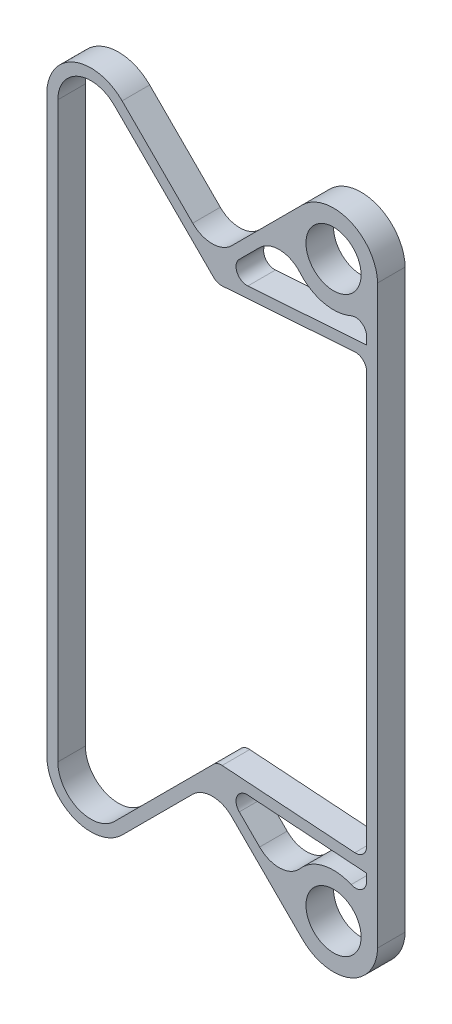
ISO-10303-21;
HEADER;
FILE_DESCRIPTION(('STEP AP214'),'2;1');
FILE_NAME('part.step','',(''),(''),'','','');
FILE_SCHEMA(('AUTOMOTIVE_DESIGN { 1 0 10303 214 1 1 1 1 }'));
ENDSEC;
DATA;
#1=APPLICATION_CONTEXT('core data for automotive mechanical design processes');
#2=APPLICATION_PROTOCOL_DEFINITION('international standard','automotive_design',2000,#1);
#3=PRODUCT_CONTEXT('',#1,'mechanical');
#4=PRODUCT('Part','Part','',(#3));
#5=PRODUCT_RELATED_PRODUCT_CATEGORY('part','',(#4));
#6=PRODUCT_DEFINITION_FORMATION('','',#4);
#7=PRODUCT_DEFINITION_CONTEXT('part definition',#1,'design');
#8=PRODUCT_DEFINITION('design','',#6,#7);
#9=PRODUCT_DEFINITION_SHAPE('','',#8);
#10=(LENGTH_UNIT() NAMED_UNIT(*) SI_UNIT(.MILLI.,.METRE.));
#11=(NAMED_UNIT(*) PLANE_ANGLE_UNIT() SI_UNIT($,.RADIAN.));
#12=(NAMED_UNIT(*) SI_UNIT($,.STERADIAN.) SOLID_ANGLE_UNIT());
#13=UNCERTAINTY_MEASURE_WITH_UNIT(LENGTH_MEASURE(1.E-05),#10,'distance_accuracy_value','');
#14=(GEOMETRIC_REPRESENTATION_CONTEXT(3) GLOBAL_UNCERTAINTY_ASSIGNED_CONTEXT((#13)) GLOBAL_UNIT_ASSIGNED_CONTEXT((#10,
#11,#12)) REPRESENTATION_CONTEXT('',''));
#15=CARTESIAN_POINT('',(0.,0.,0.));
#16=DIRECTION('',(0.,0.,1.));
#17=DIRECTION('',(1.,0.,0.));
#18=AXIS2_PLACEMENT_3D('',#15,#16,#17);
#19=CARTESIAN_POINT('',(192.426406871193,192.426406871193,50.));
#20=DIRECTION('',(0.707106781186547,0.707106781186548,0.));
#21=DIRECTION('',(-0.707106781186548,0.707106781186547,0.));
#22=AXIS2_PLACEMENT_3D('',#19,#20,#21);
#23=PLANE('',#22);
#24=DIRECTION('',(0.707106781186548,-0.707106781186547,0.));
#25=VECTOR('',#24,1.);
#26=CARTESIAN_POINT('',(192.426406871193,192.426406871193,0.));
#27=LINE('',#26,#25);
#28=CARTESIAN_POINT('',(-177.573593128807,562.426406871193,0.));
#29=VERTEX_POINT('',#28);
#30=CARTESIAN_POINT('',(2.50101613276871,382.351797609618,0.));
#31=VERTEX_POINT('',#30);
#32=EDGE_CURVE('E270',#29,#31,#27,.T.);
#33=ORIENTED_EDGE('',*,*,#32,.T.);
#34=DIRECTION('',(0.,0.,-1.));
#35=VECTOR('',#34,1.);
#36=CARTESIAN_POINT('',(2.50101613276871,382.351797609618,50.));
#37=LINE('',#36,#35);
#38=CARTESIAN_POINT('',(2.50101613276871,382.351797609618,50.));
#39=VERTEX_POINT('',#38);
#40=EDGE_CURVE('E12',#39,#31,#37,.T.);
#41=ORIENTED_EDGE('',*,*,#40,.F.);
#42=DIRECTION('',(0.707106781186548,-0.707106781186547,0.));
#43=VECTOR('',#42,1.);
#44=CARTESIAN_POINT('',(192.426406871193,192.426406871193,50.));
#45=LINE('',#44,#43);
#46=CARTESIAN_POINT('',(-177.573593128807,562.426406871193,50.));
#47=VERTEX_POINT('',#46);
#48=EDGE_CURVE('E416',#47,#39,#45,.T.);
#49=ORIENTED_EDGE('',*,*,#48,.F.);
#50=DIRECTION('',(0.,0.,-1.));
#51=VECTOR('',#50,1.);
#52=CARTESIAN_POINT('',(-177.573593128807,562.426406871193,50.));
#53=LINE('',#52,#51);
#54=EDGE_CURVE('E69',#47,#29,#53,.T.);
#55=ORIENTED_EDGE('',*,*,#54,.T.);
#56=EDGE_LOOP('',(#33,#41,#49,#55));
#57=FACE_BOUND('',#56,.T.);
#58=ADVANCED_FACE('F49',(#57),#23,.F.);
#59=CARTESIAN_POINT('',(16.6431517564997,396.493933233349,50.));
#60=DIRECTION('',(0.,0.,-1.));
#61=DIRECTION('',(-1.,0.,0.));
#62=AXIS2_PLACEMENT_3D('',#59,#60,#61);
#63=CYLINDRICAL_SURFACE('',#62,20.);
#64=CARTESIAN_POINT('',(16.6431517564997,396.493933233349,0.));
#65=DIRECTION('',(0.,0.,1.));
#66=DIRECTION('',(1.,0.,0.));
#67=AXIS2_PLACEMENT_3D('',#64,#65,#66);
#68=CIRCLE('',#67,20.);
#69=CARTESIAN_POINT('',(18.0308982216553,376.542137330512,0.));
#70=VERTEX_POINT('',#69);
#71=EDGE_CURVE('E273',#31,#70,#68,.T.);
#72=ORIENTED_EDGE('',*,*,#71,.T.);
#73=DIRECTION('',(0.,0.,-1.));
#74=VECTOR('',#73,1.);
#75=CARTESIAN_POINT('',(18.0308982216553,376.542137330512,50.));
#76=LINE('',#75,#74);
#77=CARTESIAN_POINT('',(18.0308982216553,376.542137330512,50.));
#78=VERTEX_POINT('',#77);
#79=EDGE_CURVE('E60',#78,#70,#76,.T.);
#80=ORIENTED_EDGE('',*,*,#79,.F.);
#81=CARTESIAN_POINT('',(16.6431517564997,396.493933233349,50.));
#82=DIRECTION('',(0.,0.,1.));
#83=DIRECTION('',(1.,0.,0.));
#84=AXIS2_PLACEMENT_3D('',#81,#82,#83);
#85=CIRCLE('',#84,20.);
#86=EDGE_CURVE('E420',#39,#78,#85,.T.);
#87=ORIENTED_EDGE('',*,*,#86,.F.);
#88=ORIENTED_EDGE('',*,*,#40,.T.);
#89=EDGE_LOOP('',(#72,#80,#87,#88));
#90=FACE_BOUND('',#89,.T.);
#91=ADVANCED_FACE('F566',(#90),#63,.T.);
#92=CARTESIAN_POINT('',(-25.9774674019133,373.481137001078,50.));
#93=DIRECTION('',(0.0693873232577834,-0.997589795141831,0.));
#94=DIRECTION('',(0.997589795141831,0.0693873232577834,0.));
#95=AXIS2_PLACEMENT_3D('',#92,#93,#94);
#96=PLANE('',#95);
#97=DIRECTION('',(-0.997589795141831,-0.0693873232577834,0.));
#98=VECTOR('',#97,1.);
#99=CARTESIAN_POINT('',(-25.9774674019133,373.481137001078,0.));
#100=LINE('',#99,#98);
#101=CARTESIAN_POINT('',(258.579458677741,393.273484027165,0.));
#102=VERTEX_POINT('',#101);
#103=EDGE_CURVE('E277',#102,#70,#100,.T.);
#104=ORIENTED_EDGE('',*,*,#103,.F.);
#105=DIRECTION('',(0.,0.,-1.));
#106=VECTOR('',#105,1.);
#107=CARTESIAN_POINT('',(258.579458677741,393.273484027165,50.));
#108=LINE('',#107,#106);
#109=CARTESIAN_POINT('',(258.579458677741,393.273484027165,50.));
#110=VERTEX_POINT('',#109);
#111=EDGE_CURVE('E344',#110,#102,#108,.T.);
#112=ORIENTED_EDGE('',*,*,#111,.F.);
#113=DIRECTION('',(-0.997589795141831,-0.0693873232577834,0.));
#114=VECTOR('',#113,1.);
#115=CARTESIAN_POINT('',(-25.9774674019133,373.481137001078,50.));
#116=LINE('',#115,#114);
#117=EDGE_CURVE('E423',#110,#78,#116,.T.);
#118=ORIENTED_EDGE('',*,*,#117,.T.);
#119=ORIENTED_EDGE('',*,*,#79,.T.);
#120=EDGE_LOOP('',(#104,#112,#118,#119));
#121=FACE_BOUND('',#120,.T.);
#122=ADVANCED_FACE('F571',(#121),#96,.T.);
#123=CARTESIAN_POINT('',(259.967205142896,373.321688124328,50.));
#124=DIRECTION('',(0.,0.,-1.));
#125=DIRECTION('',(-1.,0.,0.));
#126=AXIS2_PLACEMENT_3D('',#123,#124,#125);
#127=CYLINDRICAL_SURFACE('',#126,20.);
#128=CARTESIAN_POINT('',(259.967205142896,373.321688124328,0.));
#129=DIRECTION('',(0.,0.,1.));
#130=DIRECTION('',(1.,0.,0.));
#131=AXIS2_PLACEMENT_3D('',#128,#129,#130);
#132=CIRCLE('',#131,20.);
#133=CARTESIAN_POINT('',(279.967205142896,373.321688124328,0.));
#134=VERTEX_POINT('',#133);
#135=EDGE_CURVE('E281',#134,#102,#132,.T.);
#136=ORIENTED_EDGE('',*,*,#135,.F.);
#137=DIRECTION('',(0.,0.,-1.));
#138=VECTOR('',#137,1.);
#139=CARTESIAN_POINT('',(279.967205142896,373.321688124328,50.));
#140=LINE('',#139,#138);
#141=CARTESIAN_POINT('',(279.967205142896,373.321688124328,50.));
#142=VERTEX_POINT('',#141);
#143=EDGE_CURVE('E341',#142,#134,#140,.T.);
#144=ORIENTED_EDGE('',*,*,#143,.F.);
#145=CARTESIAN_POINT('',(259.967205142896,373.321688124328,50.));
#146=DIRECTION('',(0.,0.,1.));
#147=DIRECTION('',(1.,0.,0.));
#148=AXIS2_PLACEMENT_3D('',#145,#146,#147);
#149=CIRCLE('',#148,20.);
#150=EDGE_CURVE('E427',#142,#110,#149,.T.);
#151=ORIENTED_EDGE('',*,*,#150,.T.);
#152=ORIENTED_EDGE('',*,*,#111,.T.);
#153=EDGE_LOOP('',(#136,#144,#151,#152));
#154=FACE_BOUND('',#153,.T.);
#155=ADVANCED_FACE('F631',(#154),#127,.F.);
#156=CARTESIAN_POINT('',(279.967205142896,0.,50.));
#157=DIRECTION('',(-1.,0.,0.));
#158=DIRECTION('',(0.,-1.,0.));
#159=AXIS2_PLACEMENT_3D('',#156,#157,#158);
#160=PLANE('',#159);
#161=DIRECTION('',(0.,1.,0.));
#162=VECTOR('',#161,1.);
#163=CARTESIAN_POINT('',(279.967205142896,0.,0.));
#164=LINE('',#163,#162);
#165=CARTESIAN_POINT('',(279.967205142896,-373.321688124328,0.));
#166=VERTEX_POINT('',#165);
#167=EDGE_CURVE('E285',#166,#134,#164,.T.);
#168=ORIENTED_EDGE('',*,*,#167,.F.);
#169=DIRECTION('',(0.,0.,-1.));
#170=VECTOR('',#169,1.);
#171=CARTESIAN_POINT('',(279.967205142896,-373.321688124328,50.));
#172=LINE('',#171,#170);
#173=CARTESIAN_POINT('',(279.967205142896,-373.321688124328,50.));
#174=VERTEX_POINT('',#173);
#175=EDGE_CURVE('E499',#174,#166,#172,.T.);
#176=ORIENTED_EDGE('',*,*,#175,.F.);
#177=DIRECTION('',(0.,1.,0.));
#178=VECTOR('',#177,1.);
#179=CARTESIAN_POINT('',(279.967205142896,0.,50.));
#180=LINE('',#179,#178);
#181=EDGE_CURVE('E431',#174,#142,#180,.T.);
#182=ORIENTED_EDGE('',*,*,#181,.T.);
#183=ORIENTED_EDGE('',*,*,#143,.T.);
#184=EDGE_LOOP('',(#168,#176,#182,#183));
#185=FACE_BOUND('',#184,.T.);
#186=ADVANCED_FACE('F627',(#185),#160,.T.);
#187=CARTESIAN_POINT('',(299.967205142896,0.,50.));
#188=DIRECTION('',(-1.,0.,0.));
#189=DIRECTION('',(0.,0.,1.));
#190=AXIS2_PLACEMENT_3D('',#187,#188,#189);
#191=PLANE('',#190);
#192=DIRECTION('',(0.,1.,0.));
#193=VECTOR('',#192,1.);
#194=CARTESIAN_POINT('',(299.967205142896,0.,0.));
#195=LINE('',#194,#193);
#196=CARTESIAN_POINT('',(299.967205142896,-522.290436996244,0.));
#197=VERTEX_POINT('',#196);
#198=CARTESIAN_POINT('',(299.967205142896,522.290436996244,0.));
#199=VERTEX_POINT('',#198);
#200=EDGE_CURVE('E289',#197,#199,#195,.T.);
#201=ORIENTED_EDGE('',*,*,#200,.T.);
#202=DIRECTION('',(0.,0.,-1.));
#203=VECTOR('',#202,1.);
#204=CARTESIAN_POINT('',(299.967205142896,522.290436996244,50.));
#205=LINE('',#204,#203);
#206=CARTESIAN_POINT('',(299.967205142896,522.290436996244,50.));
#207=VERTEX_POINT('',#206);
#208=EDGE_CURVE('E337',#207,#199,#205,.T.);
#209=ORIENTED_EDGE('',*,*,#208,.F.);
#210=DIRECTION('',(0.,1.,0.));
#211=VECTOR('',#210,1.);
#212=CARTESIAN_POINT('',(299.967205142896,0.,50.));
#213=LINE('',#212,#211);
#214=CARTESIAN_POINT('',(299.967205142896,-522.290436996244,50.));
#215=VERTEX_POINT('',#214);
#216=EDGE_CURVE('E435',#215,#207,#213,.T.);
#217=ORIENTED_EDGE('',*,*,#216,.F.);
#218=DIRECTION('',(0.,0.,-1.));
#219=VECTOR('',#218,1.);
#220=CARTESIAN_POINT('',(299.967205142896,-522.290436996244,50.));
#221=LINE('',#220,#219);
#222=EDGE_CURVE('E495',#215,#197,#221,.T.);
#223=ORIENTED_EDGE('',*,*,#222,.T.);
#224=EDGE_LOOP('',(#201,#209,#217,#223));
#225=FACE_BOUND('',#224,.T.);
#226=ADVANCED_FACE('F623',(#225),#191,.F.);
#227=CARTESIAN_POINT('',(219.999999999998,519.999999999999,50.));
#228=DIRECTION('',(0.,0.,-1.));
#229=DIRECTION('',(-1.,0.,0.));
#230=AXIS2_PLACEMENT_3D('',#227,#228,#229);
#231=CYLINDRICAL_SURFACE('',#230,80.0000000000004);
#232=CARTESIAN_POINT('',(219.999999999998,519.999999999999,0.));
#233=DIRECTION('',(0.,0.,1.));
#234=DIRECTION('',(1.,0.,0.));
#235=AXIS2_PLACEMENT_3D('',#232,#233,#234);
#236=CIRCLE('',#235,80.0000000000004);
#237=CARTESIAN_POINT('',(163.431457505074,576.568542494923,0.));
#238=VERTEX_POINT('',#237);
#239=EDGE_CURVE('E292',#199,#238,#236,.T.);
#240=ORIENTED_EDGE('',*,*,#239,.T.);
#241=DIRECTION('',(0.,0.,-1.));
#242=VECTOR('',#241,1.);
#243=CARTESIAN_POINT('',(163.431457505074,576.568542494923,50.));
#244=LINE('',#243,#242);
#245=CARTESIAN_POINT('',(163.431457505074,576.568542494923,50.));
#246=VERTEX_POINT('',#245);
#247=EDGE_CURVE('E334',#246,#238,#244,.T.);
#248=ORIENTED_EDGE('',*,*,#247,.F.);
#249=CARTESIAN_POINT('',(219.999999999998,519.999999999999,50.));
#250=DIRECTION('',(0.,0.,1.));
#251=DIRECTION('',(1.,0.,0.));
#252=AXIS2_PLACEMENT_3D('',#249,#250,#251);
#253=CIRCLE('',#252,80.0000000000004);
#254=EDGE_CURVE('E438',#207,#246,#253,.T.);
#255=ORIENTED_EDGE('',*,*,#254,.F.);
#256=ORIENTED_EDGE('',*,*,#208,.T.);
#257=EDGE_LOOP('',(#240,#248,#255,#256));
#258=FACE_BOUND('',#257,.T.);
#259=ADVANCED_FACE('F619',(#258),#231,.T.);
#260=CARTESIAN_POINT('',(-206.568542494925,206.568542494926,50.));
#261=DIRECTION('',(-0.707106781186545,0.70710678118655,0.));
#262=DIRECTION('',(-0.70710678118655,-0.707106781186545,0.));
#263=AXIS2_PLACEMENT_3D('',#260,#261,#262);
#264=PLANE('',#263);
#265=DIRECTION('',(0.70710678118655,0.707106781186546,0.));
#266=VECTOR('',#265,1.);
#267=CARTESIAN_POINT('',(-206.568542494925,206.568542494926,0.));
#268=LINE('',#267,#266);
#269=CARTESIAN_POINT('',(35.355339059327,448.492424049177,0.));
#270=VERTEX_POINT('',#269);
#271=EDGE_CURVE('E296',#270,#238,#268,.T.);
#272=ORIENTED_EDGE('',*,*,#271,.F.);
#273=DIRECTION('',(0.,0.,-1.));
#274=VECTOR('',#273,1.);
#275=CARTESIAN_POINT('',(35.355339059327,448.492424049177,50.));
#276=LINE('',#275,#274);
#277=CARTESIAN_POINT('',(35.355339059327,448.492424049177,50.));
#278=VERTEX_POINT('',#277);
#279=EDGE_CURVE('E331',#278,#270,#276,.T.);
#280=ORIENTED_EDGE('',*,*,#279,.F.);
#281=DIRECTION('',(0.70710678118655,0.707106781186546,0.));
#282=VECTOR('',#281,1.);
#283=CARTESIAN_POINT('',(-206.568542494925,206.568542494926,50.));
#284=LINE('',#283,#282);
#285=EDGE_CURVE('E441',#278,#246,#284,.T.);
#286=ORIENTED_EDGE('',*,*,#285,.T.);
#287=ORIENTED_EDGE('',*,*,#247,.T.);
#288=EDGE_LOOP('',(#272,#280,#286,#287));
#289=FACE_BOUND('',#288,.T.);
#290=ADVANCED_FACE('F615',(#289),#264,.T.);
#291=CARTESIAN_POINT('',(-4.9960036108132E-13,483.847763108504,50.));
#292=DIRECTION('',(0.,0.,-1.));
#293=DIRECTION('',(-1.,0.,0.));
#294=AXIS2_PLACEMENT_3D('',#291,#292,#293);
#295=CYLINDRICAL_SURFACE('',#294,50.);
#296=CARTESIAN_POINT('',(-4.9960036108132E-13,483.847763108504,0.));
#297=DIRECTION('',(0.,0.,1.));
#298=DIRECTION('',(1.,0.,0.));
#299=AXIS2_PLACEMENT_3D('',#296,#297,#298);
#300=CIRCLE('',#299,50.);
#301=CARTESIAN_POINT('',(-35.3553390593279,448.492424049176,0.));
#302=VERTEX_POINT('',#301);
#303=EDGE_CURVE('E300',#270,#302,#300,.F.);
#304=ORIENTED_EDGE('',*,*,#303,.T.);
#305=DIRECTION('',(0.,0.,-1.));
#306=VECTOR('',#305,1.);
#307=CARTESIAN_POINT('',(-35.3553390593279,448.492424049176,50.));
#308=LINE('',#307,#306);
#309=CARTESIAN_POINT('',(-35.3553390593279,448.492424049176,50.));
#310=VERTEX_POINT('',#309);
#311=EDGE_CURVE('E328',#310,#302,#308,.T.);
#312=ORIENTED_EDGE('',*,*,#311,.F.);
#313=CARTESIAN_POINT('',(-4.9960036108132E-13,483.847763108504,50.));
#314=DIRECTION('',(0.,0.,1.));
#315=DIRECTION('',(1.,0.,0.));
#316=AXIS2_PLACEMENT_3D('',#313,#314,#315);
#317=CIRCLE('',#316,50.);
#318=EDGE_CURVE('E445',#278,#310,#317,.F.);
#319=ORIENTED_EDGE('',*,*,#318,.F.);
#320=ORIENTED_EDGE('',*,*,#279,.T.);
#321=EDGE_LOOP('',(#304,#312,#319,#320));
#322=FACE_BOUND('',#321,.T.);
#323=ADVANCED_FACE('F612',(#322),#295,.F.);
#324=CARTESIAN_POINT('',(206.568542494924,206.568542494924,50.));
#325=DIRECTION('',(0.707106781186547,0.707106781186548,0.));
#326=DIRECTION('',(-0.707106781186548,0.707106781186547,0.));
#327=AXIS2_PLACEMENT_3D('',#324,#325,#326);
#328=PLANE('',#327);
#329=DIRECTION('',(0.707106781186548,-0.707106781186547,0.));
#330=VECTOR('',#329,1.);
#331=CARTESIAN_POINT('',(206.568542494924,206.568542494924,0.));
#332=LINE('',#331,#330);
#333=CARTESIAN_POINT('',(-163.431457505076,576.568542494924,0.));
#334=VERTEX_POINT('',#333);
#335=EDGE_CURVE('E304',#334,#302,#332,.T.);
#336=ORIENTED_EDGE('',*,*,#335,.F.);
#337=DIRECTION('',(0.,0.,-1.));
#338=VECTOR('',#337,1.);
#339=CARTESIAN_POINT('',(-163.431457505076,576.568542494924,50.));
#340=LINE('',#339,#338);
#341=CARTESIAN_POINT('',(-163.431457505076,576.568542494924,50.));
#342=VERTEX_POINT('',#341);
#343=EDGE_CURVE('E218',#342,#334,#340,.T.);
#344=ORIENTED_EDGE('',*,*,#343,.F.);
#345=DIRECTION('',(0.707106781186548,-0.707106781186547,0.));
#346=VECTOR('',#345,1.);
#347=CARTESIAN_POINT('',(206.568542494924,206.568542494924,50.));
#348=LINE('',#347,#346);
#349=EDGE_CURVE('E205',#342,#310,#348,.T.);
#350=ORIENTED_EDGE('',*,*,#349,.T.);
#351=ORIENTED_EDGE('',*,*,#311,.T.);
#352=EDGE_LOOP('',(#336,#344,#350,#351));
#353=FACE_BOUND('',#352,.T.);
#354=ADVANCED_FACE('F451',(#353),#328,.T.);
#355=CARTESIAN_POINT('',(-220.,520.,50.));
#356=DIRECTION('',(0.,0.,-1.));
#357=DIRECTION('',(-1.,0.,0.));
#358=AXIS2_PLACEMENT_3D('',#355,#356,#357);
#359=CYLINDRICAL_SURFACE('',#358,80.0000000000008);
#360=CARTESIAN_POINT('',(-220.,520.,0.));
#361=DIRECTION('',(0.,0.,1.));
#362=DIRECTION('',(1.,0.,0.));
#363=AXIS2_PLACEMENT_3D('',#360,#361,#362);
#364=CIRCLE('',#363,80.0000000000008);
#365=CARTESIAN_POINT('',(-300.000000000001,519.999999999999,0.));
#366=VERTEX_POINT('',#365);
#367=EDGE_CURVE('E213',#334,#366,#364,.T.);
#368=ORIENTED_EDGE('',*,*,#367,.T.);
#369=DIRECTION('',(0.,0.,-1.));
#370=VECTOR('',#369,1.);
#371=CARTESIAN_POINT('',(-300.000000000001,519.999999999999,50.));
#372=LINE('',#371,#370);
#373=CARTESIAN_POINT('',(-300.000000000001,519.999999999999,50.));
#374=VERTEX_POINT('',#373);
#375=EDGE_CURVE('E210',#374,#366,#372,.T.);
#376=ORIENTED_EDGE('',*,*,#375,.F.);
#377=CARTESIAN_POINT('',(-220.,520.,50.));
#378=DIRECTION('',(0.,0.,1.));
#379=DIRECTION('',(1.,0.,0.));
#380=AXIS2_PLACEMENT_3D('',#377,#378,#379);
#381=CIRCLE('',#380,80.0000000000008);
#382=EDGE_CURVE('E194',#342,#374,#381,.T.);
#383=ORIENTED_EDGE('',*,*,#382,.F.);
#384=ORIENTED_EDGE('',*,*,#343,.T.);
#385=EDGE_LOOP('',(#368,#376,#383,#384));
#386=FACE_BOUND('',#385,.T.);
#387=ADVANCED_FACE('F211',(#386),#359,.T.);
#388=CARTESIAN_POINT('',(-300.000000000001,0.,50.));
#389=DIRECTION('',(1.,0.,0.));
#390=DIRECTION('',(0.,0.,-1.));
#391=AXIS2_PLACEMENT_3D('',#388,#389,#390);
#392=PLANE('',#391);
#393=DIRECTION('',(0.,-1.,0.));
#394=VECTOR('',#393,1.);
#395=CARTESIAN_POINT('',(-300.000000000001,0.,0.));
#396=LINE('',#395,#394);
#397=CARTESIAN_POINT('',(-300.000000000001,-519.999999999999,0.));
#398=VERTEX_POINT('',#397);
#399=EDGE_CURVE('E310',#366,#398,#396,.T.);
#400=ORIENTED_EDGE('',*,*,#399,.T.);
#401=DIRECTION('',(0.,0.,-1.));
#402=VECTOR('',#401,1.);
#403=CARTESIAN_POINT('',(-300.000000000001,-519.999999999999,50.));
#404=LINE('',#403,#402);
#405=CARTESIAN_POINT('',(-300.000000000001,-519.999999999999,50.));
#406=VERTEX_POINT('',#405);
#407=EDGE_CURVE('E222',#406,#398,#404,.T.);
#408=ORIENTED_EDGE('',*,*,#407,.F.);
#409=DIRECTION('',(0.,-1.,0.));
#410=VECTOR('',#409,1.);
#411=CARTESIAN_POINT('',(-300.000000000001,0.,50.));
#412=LINE('',#411,#410);
#413=EDGE_CURVE('E202',#374,#406,#412,.T.);
#414=ORIENTED_EDGE('',*,*,#413,.F.);
#415=ORIENTED_EDGE('',*,*,#375,.T.);
#416=EDGE_LOOP('',(#400,#408,#414,#415));
#417=FACE_BOUND('',#416,.T.);
#418=ADVANCED_FACE('F220',(#417),#392,.F.);
#419=CARTESIAN_POINT('',(-280.000000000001,0.,50.));
#420=DIRECTION('',(1.,0.,0.));
#421=DIRECTION('',(0.,1.,0.));
#422=AXIS2_PLACEMENT_3D('',#419,#420,#421);
#423=PLANE('',#422);
#424=DIRECTION('',(0.,-1.,0.));
#425=VECTOR('',#424,1.);
#426=CARTESIAN_POINT('',(-280.000000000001,0.,0.));
#427=LINE('',#426,#425);
#428=CARTESIAN_POINT('',(-280.000000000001,520.,0.));
#429=VERTEX_POINT('',#428);
#430=CARTESIAN_POINT('',(-280.000000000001,-520.,0.));
#431=VERTEX_POINT('',#430);
#432=EDGE_CURVE('E313',#429,#431,#427,.T.);
#433=ORIENTED_EDGE('',*,*,#432,.F.);
#434=DIRECTION('',(0.,0.,-1.));
#435=VECTOR('',#434,1.);
#436=CARTESIAN_POINT('',(-280.000000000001,520.,50.));
#437=LINE('',#436,#435);
#438=CARTESIAN_POINT('',(-280.000000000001,520.,50.));
#439=VERTEX_POINT('',#438);
#440=EDGE_CURVE('E129',#439,#429,#437,.T.);
#441=ORIENTED_EDGE('',*,*,#440,.F.);
#442=DIRECTION('',(0.,-1.,0.));
#443=VECTOR('',#442,1.);
#444=CARTESIAN_POINT('',(-280.000000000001,0.,50.));
#445=LINE('',#444,#443);
#446=CARTESIAN_POINT('',(-280.000000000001,-520.,50.));
#447=VERTEX_POINT('',#446);
#448=EDGE_CURVE('E225',#439,#447,#445,.T.);
#449=ORIENTED_EDGE('',*,*,#448,.T.);
#450=DIRECTION('',(0.,0.,-1.));
#451=VECTOR('',#450,1.);
#452=CARTESIAN_POINT('',(-280.000000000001,-520.,50.));
#453=LINE('',#452,#451);
#454=EDGE_CURVE('E472',#447,#431,#453,.T.);
#455=ORIENTED_EDGE('',*,*,#454,.T.);
#456=EDGE_LOOP('',(#433,#441,#449,#455));
#457=FACE_BOUND('',#456,.T.);
#458=ADVANCED_FACE('F602',(#457),#423,.T.);
#459=CARTESIAN_POINT('',(259.967205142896,428.334180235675,50.));
#460=DIRECTION('',(0.,0.,-1.));
#461=DIRECTION('',(-1.,0.,0.));
#462=AXIS2_PLACEMENT_3D('',#459,#460,#461);
#463=CYLINDRICAL_SURFACE('',#462,20.);
#464=CARTESIAN_POINT('',(259.967205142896,428.334180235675,0.));
#465=DIRECTION('',(0.,0.,1.));
#466=DIRECTION('',(1.,0.,0.));
#467=AXIS2_PLACEMENT_3D('',#464,#465,#466);
#468=CIRCLE('',#467,20.);
#469=CARTESIAN_POINT('',(279.967205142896,428.334180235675,0.));
#470=VERTEX_POINT('',#469);
#471=CARTESIAN_POINT('',(251.973764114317,446.667344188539,0.));
#472=VERTEX_POINT('',#471);
#473=EDGE_CURVE('E241',#470,#472,#468,.T.);
#474=ORIENTED_EDGE('',*,*,#473,.F.);
#475=DIRECTION('',(0.,0.,-1.));
#476=VECTOR('',#475,1.);
#477=CARTESIAN_POINT('',(279.967205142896,428.334180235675,50.));
#478=LINE('',#477,#476);
#479=CARTESIAN_POINT('',(279.967205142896,428.334180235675,50.));
#480=VERTEX_POINT('',#479);
#481=EDGE_CURVE('E53',#480,#470,#478,.T.);
#482=ORIENTED_EDGE('',*,*,#481,.F.);
#483=CARTESIAN_POINT('',(259.967205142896,428.334180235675,50.));
#484=DIRECTION('',(0.,0.,1.));
#485=DIRECTION('',(1.,0.,0.));
#486=AXIS2_PLACEMENT_3D('',#483,#484,#485);
#487=CIRCLE('',#486,20.);
#488=CARTESIAN_POINT('',(251.973764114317,446.667344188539,50.));
#489=VERTEX_POINT('',#488);
#490=EDGE_CURVE('E402',#480,#489,#487,.T.);
#491=ORIENTED_EDGE('',*,*,#490,.T.);
#492=DIRECTION('',(0.,0.,-1.));
#493=VECTOR('',#492,1.);
#494=CARTESIAN_POINT('',(251.973764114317,446.667344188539,50.));
#495=LINE('',#494,#493);
#496=EDGE_CURVE('E236',#489,#472,#495,.T.);
#497=ORIENTED_EDGE('',*,*,#496,.T.);
#498=EDGE_LOOP('',(#474,#482,#491,#497));
#499=FACE_BOUND('',#498,.T.);
#500=ADVANCED_FACE('F378',(#499),#463,.F.);
#501=CARTESIAN_POINT('',(279.967205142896,0.,50.));
#502=DIRECTION('',(-1.,0.,0.));
#503=DIRECTION('',(0.,0.,1.));
#504=AXIS2_PLACEMENT_3D('',#501,#502,#503);
#505=PLANE('',#504);
#506=DIRECTION('',(0.,1.,0.));
#507=VECTOR('',#506,1.);
#508=CARTESIAN_POINT('',(279.967205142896,0.,0.));
#509=LINE('',#508,#507);
#510=CARTESIAN_POINT('',(279.967205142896,414.809428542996,0.));
#511=VERTEX_POINT('',#510);
#512=EDGE_CURVE('E246',#511,#470,#509,.T.);
#513=ORIENTED_EDGE('',*,*,#512,.F.);
#514=DIRECTION('',(0.,0.,-1.));
#515=VECTOR('',#514,1.);
#516=CARTESIAN_POINT('',(279.967205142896,414.809428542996,50.));
#517=LINE('',#516,#515);
#518=CARTESIAN_POINT('',(279.967205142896,414.809428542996,50.));
#519=VERTEX_POINT('',#518);
#520=EDGE_CURVE('E364',#519,#511,#517,.T.);
#521=ORIENTED_EDGE('',*,*,#520,.F.);
#522=DIRECTION('',(0.,1.,0.));
#523=VECTOR('',#522,1.);
#524=CARTESIAN_POINT('',(279.967205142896,0.,50.));
#525=LINE('',#524,#523);
#526=EDGE_CURVE('E377',#519,#480,#525,.T.);
#527=ORIENTED_EDGE('',*,*,#526,.T.);
#528=ORIENTED_EDGE('',*,*,#481,.T.);
#529=EDGE_LOOP('',(#513,#521,#527,#528));
#530=FACE_BOUND('',#529,.T.);
#531=ADVANCED_FACE('F375',(#530),#505,.T.);
#532=CARTESIAN_POINT('',(-27.3652138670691,393.432932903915,50.));
#533=DIRECTION('',(0.0693873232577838,-0.997589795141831,0.));
#534=DIRECTION('',(0.997589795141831,0.0693873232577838,0.));
#535=AXIS2_PLACEMENT_3D('',#532,#533,#534);
#536=PLANE('',#535);
#537=DIRECTION('',(-0.997589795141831,-0.0693873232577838,0.));
#538=VECTOR('',#537,1.);
#539=CARTESIAN_POINT('',(-27.3652138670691,393.432932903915,0.));
#540=LINE('',#539,#538);
#541=CARTESIAN_POINT('',(64.600612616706,399.829612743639,0.));
#542=VERTEX_POINT('',#541);
#543=EDGE_CURVE('E250',#511,#542,#540,.T.);
#544=ORIENTED_EDGE('',*,*,#543,.T.);
#545=DIRECTION('',(0.,0.,-1.));
#546=VECTOR('',#545,1.);
#547=CARTESIAN_POINT('',(64.600612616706,399.829612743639,50.));
#548=LINE('',#547,#546);
#549=CARTESIAN_POINT('',(64.600612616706,399.829612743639,50.));
#550=VERTEX_POINT('',#549);
#551=EDGE_CURVE('E361',#550,#542,#548,.T.);
#552=ORIENTED_EDGE('',*,*,#551,.F.);
#553=DIRECTION('',(-0.997589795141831,-0.0693873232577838,0.));
#554=VECTOR('',#553,1.);
#555=CARTESIAN_POINT('',(-27.3652138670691,393.432932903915,50.));
#556=LINE('',#555,#554);
#557=EDGE_CURVE('E387',#519,#550,#556,.T.);
#558=ORIENTED_EDGE('',*,*,#557,.F.);
#559=ORIENTED_EDGE('',*,*,#520,.T.);
#560=EDGE_LOOP('',(#544,#552,#558,#559));
#561=FACE_BOUND('',#560,.T.);
#562=ADVANCED_FACE('F385',(#561),#536,.F.);
#563=CARTESIAN_POINT('',(63.2128661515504,419.781408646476,50.));
#564=DIRECTION('',(0.,0.,-1.));
#565=DIRECTION('',(-1.,0.,0.));
#566=AXIS2_PLACEMENT_3D('',#563,#564,#565);
#567=CYLINDRICAL_SURFACE('',#566,20.);
#568=CARTESIAN_POINT('',(63.2128661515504,419.781408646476,0.));
#569=DIRECTION('',(0.,0.,1.));
#570=DIRECTION('',(1.,0.,0.));
#571=AXIS2_PLACEMENT_3D('',#568,#569,#570);
#572=CIRCLE('',#571,20.);
#573=CARTESIAN_POINT('',(49.0707305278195,433.923544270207,0.));
#574=VERTEX_POINT('',#573);
#575=EDGE_CURVE('E254',#542,#574,#572,.F.);
#576=ORIENTED_EDGE('',*,*,#575,.T.);
#577=DIRECTION('',(0.,0.,-1.));
#578=VECTOR('',#577,1.);
#579=CARTESIAN_POINT('',(49.0707305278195,433.923544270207,50.));
#580=LINE('',#579,#578);
#581=CARTESIAN_POINT('',(49.0707305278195,433.923544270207,50.));
#582=VERTEX_POINT('',#581);
#583=EDGE_CURVE('E357',#582,#574,#580,.T.);
#584=ORIENTED_EDGE('',*,*,#583,.F.);
#585=CARTESIAN_POINT('',(63.2128661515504,419.781408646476,50.));
#586=DIRECTION('',(0.,0.,1.));
#587=DIRECTION('',(1.,0.,0.));
#588=AXIS2_PLACEMENT_3D('',#585,#586,#587);
#589=CIRCLE('',#588,20.);
#590=EDGE_CURVE('E392',#550,#582,#589,.F.);
#591=ORIENTED_EDGE('',*,*,#590,.F.);
#592=ORIENTED_EDGE('',*,*,#551,.T.);
#593=EDGE_LOOP('',(#576,#584,#591,#592));
#594=FACE_BOUND('',#593,.T.);
#595=ADVANCED_FACE('F389',(#594),#567,.F.);
#596=CARTESIAN_POINT('',(-192.426406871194,192.426406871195,50.));
#597=DIRECTION('',(-0.707106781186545,0.70710678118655,0.));
#598=DIRECTION('',(-0.70710678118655,-0.707106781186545,0.));
#599=AXIS2_PLACEMENT_3D('',#596,#597,#598);
#600=PLANE('',#599);
#601=DIRECTION('',(0.70710678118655,0.707106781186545,0.));
#602=VECTOR('',#601,1.);
#603=CARTESIAN_POINT('',(-192.426406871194,192.426406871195,0.));
#604=LINE('',#603,#602);
#605=CARTESIAN_POINT('',(85.9220792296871,470.774892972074,0.));
#606=VERTEX_POINT('',#605);
#607=EDGE_CURVE('E258',#574,#606,#604,.T.);
#608=ORIENTED_EDGE('',*,*,#607,.T.);
#609=DIRECTION('',(0.,0.,-1.));
#610=VECTOR('',#609,1.);
#611=CARTESIAN_POINT('',(85.9220792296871,470.774892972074,50.));
#612=LINE('',#611,#610);
#613=CARTESIAN_POINT('',(85.9220792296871,470.774892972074,50.));
#614=VERTEX_POINT('',#613);
#615=EDGE_CURVE('E354',#614,#606,#612,.T.);
#616=ORIENTED_EDGE('',*,*,#615,.F.);
#617=DIRECTION('',(0.70710678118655,0.707106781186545,0.));
#618=VECTOR('',#617,1.);
#619=CARTESIAN_POINT('',(-192.426406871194,192.426406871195,50.));
#620=LINE('',#619,#618);
#621=EDGE_CURVE('E395',#582,#614,#620,.T.);
#622=ORIENTED_EDGE('',*,*,#621,.F.);
#623=ORIENTED_EDGE('',*,*,#583,.T.);
#624=EDGE_LOOP('',(#608,#616,#622,#623));
#625=FACE_BOUND('',#624,.T.);
#626=ADVANCED_FACE('F556',(#625),#600,.F.);
#627=CARTESIAN_POINT('',(121.277418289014,435.419553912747,50.));
#628=DIRECTION('',(0.,0.,-1.));
#629=DIRECTION('',(-1.,0.,0.));
#630=AXIS2_PLACEMENT_3D('',#627,#628,#629);
#631=CYLINDRICAL_SURFACE('',#630,50.);
#632=CARTESIAN_POINT('',(121.277418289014,435.419553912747,0.));
#633=DIRECTION('',(0.,0.,1.));
#634=DIRECTION('',(1.,0.,0.));
#635=AXIS2_PLACEMENT_3D('',#632,#633,#634);
#636=CIRCLE('',#635,50.);
#637=CARTESIAN_POINT('',(159.247642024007,467.950494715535,0.));
#638=VERTEX_POINT('',#637);
#639=EDGE_CURVE('E262',#638,#606,#636,.T.);
#640=ORIENTED_EDGE('',*,*,#639,.F.);
#641=DIRECTION('',(0.,0.,-1.));
#642=VECTOR('',#641,1.);
#643=CARTESIAN_POINT('',(159.247642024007,467.950494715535,50.));
#644=LINE('',#643,#642);
#645=CARTESIAN_POINT('',(159.247642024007,467.950494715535,50.));
#646=VERTEX_POINT('',#645);
#647=EDGE_CURVE('E351',#646,#638,#644,.T.);
#648=ORIENTED_EDGE('',*,*,#647,.F.);
#649=CARTESIAN_POINT('',(121.277418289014,435.419553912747,50.));
#650=DIRECTION('',(0.,0.,1.));
#651=DIRECTION('',(1.,0.,0.));
#652=AXIS2_PLACEMENT_3D('',#649,#650,#651);
#653=CIRCLE('',#652,50.);
#654=EDGE_CURVE('E407',#646,#614,#653,.T.);
#655=ORIENTED_EDGE('',*,*,#654,.T.);
#656=ORIENTED_EDGE('',*,*,#615,.T.);
#657=EDGE_LOOP('',(#640,#648,#655,#656));
#658=FACE_BOUND('',#657,.T.);
#659=ADVANCED_FACE('F553',(#658),#631,.F.);
#660=CARTESIAN_POINT('',(219.999999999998,519.999999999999,50.));
#661=DIRECTION('',(0.,0.,-1.));
#662=DIRECTION('',(-1.,0.,0.));
#663=AXIS2_PLACEMENT_3D('',#660,#661,#662);
#664=CYLINDRICAL_SURFACE('',#663,80.000000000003);
#665=CARTESIAN_POINT('',(219.999999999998,519.999999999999,0.));
#666=DIRECTION('',(0.,0.,1.));
#667=DIRECTION('',(1.,0.,0.));
#668=AXIS2_PLACEMENT_3D('',#665,#666,#667);
#669=CIRCLE('',#668,80.000000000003);
#670=EDGE_CURVE('E266',#638,#472,#669,.T.);
#671=ORIENTED_EDGE('',*,*,#670,.T.);
#672=ORIENTED_EDGE('',*,*,#496,.F.);
#673=CARTESIAN_POINT('',(219.999999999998,519.999999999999,50.));
#674=DIRECTION('',(0.,0.,1.));
#675=DIRECTION('',(1.,0.,0.));
#676=AXIS2_PLACEMENT_3D('',#673,#674,#675);
#677=CIRCLE('',#676,80.000000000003);
#678=EDGE_CURVE('E412',#646,#489,#677,.T.);
#679=ORIENTED_EDGE('',*,*,#678,.F.);
#680=ORIENTED_EDGE('',*,*,#647,.T.);
#681=EDGE_LOOP('',(#671,#672,#679,#680));
#682=FACE_BOUND('',#681,.T.);
#683=ADVANCED_FACE('F550',(#682),#664,.T.);
#684=CARTESIAN_POINT('',(219.999999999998,519.999999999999,50.));
#685=DIRECTION('',(0.,0.,-1.));
#686=DIRECTION('',(-1.,0.,0.));
#687=AXIS2_PLACEMENT_3D('',#684,#685,#686);
#688=CYLINDRICAL_SURFACE('',#687,50.0000000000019);
#689=CARTESIAN_POINT('',(219.999999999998,519.999999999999,50.));
#690=DIRECTION('',(0.,0.,1.));
#691=DIRECTION('',(1.,0.,0.));
#692=AXIS2_PLACEMENT_3D('',#689,#690,#691);
#693=CIRCLE('',#692,50.0000000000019);
#694=CARTESIAN_POINT('',(270.,519.999999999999,50.));
#695=VERTEX_POINT('',#694);
#696=EDGE_CURVE('E321',#695,#695,#693,.T.);
#697=ORIENTED_EDGE('',*,*,#696,.T.);
#698=EDGE_LOOP('',(#697));
#699=FACE_BOUND('',#698,.T.);
#700=CARTESIAN_POINT('',(219.999999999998,519.999999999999,0.));
#701=DIRECTION('',(0.,0.,1.));
#702=DIRECTION('',(1.,0.,0.));
#703=AXIS2_PLACEMENT_3D('',#700,#701,#702);
#704=CIRCLE('',#703,50.0000000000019);
#705=CARTESIAN_POINT('',(270.,519.999999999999,0.));
#706=VERTEX_POINT('',#705);
#707=EDGE_CURVE('E237',#706,#706,#704,.T.);
#708=ORIENTED_EDGE('',*,*,#707,.F.);
#709=EDGE_LOOP('',(#708));
#710=FACE_BOUND('',#709,.T.);
#711=ADVANCED_FACE('F51',(#699,#710),#688,.F.);
#712=CARTESIAN_POINT('',(-220.,520.,50.));
#713=DIRECTION('',(0.,0.,-1.));
#714=DIRECTION('',(-1.,0.,0.));
#715=AXIS2_PLACEMENT_3D('',#712,#713,#714);
#716=CYLINDRICAL_SURFACE('',#715,60.0000000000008);
#717=CARTESIAN_POINT('',(-220.,520.,0.));
#718=DIRECTION('',(0.,0.,1.));
#719=DIRECTION('',(1.,0.,0.));
#720=AXIS2_PLACEMENT_3D('',#717,#718,#719);
#721=CIRCLE('',#720,60.0000000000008);
#722=EDGE_CURVE('E317',#29,#429,#721,.T.);
#723=ORIENTED_EDGE('',*,*,#722,.F.);
#724=ORIENTED_EDGE('',*,*,#54,.F.);
#725=CARTESIAN_POINT('',(-220.,520.,50.));
#726=DIRECTION('',(0.,0.,1.));
#727=DIRECTION('',(1.,0.,0.));
#728=AXIS2_PLACEMENT_3D('',#725,#726,#727);
#729=CIRCLE('',#728,60.0000000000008);
#730=EDGE_CURVE('E230',#47,#439,#729,.T.);
#731=ORIENTED_EDGE('',*,*,#730,.T.);
#732=ORIENTED_EDGE('',*,*,#440,.T.);
#733=EDGE_LOOP('',(#723,#724,#731,#732));
#734=FACE_BOUND('',#733,.T.);
#735=ADVANCED_FACE('F580',(#734),#716,.F.);
#736=CARTESIAN_POINT('',(0.,0.,50.));
#737=DIRECTION('',(0.,0.,1.));
#738=DIRECTION('',(1.,0.,0.));
#739=AXIS2_PLACEMENT_3D('',#736,#737,#738);
#740=PLANE('',#739);
#741=CARTESIAN_POINT('',(219.999999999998,-519.999999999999,50.));
#742=DIRECTION('',(0.,0.,-1.));
#743=DIRECTION('',(1.,0.,0.));
#744=AXIS2_PLACEMENT_3D('',#741,#742,#743);
#745=CIRCLE('',#744,80.0000000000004);
#746=CARTESIAN_POINT('',(163.431457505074,-576.568542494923,50.));
#747=VERTEX_POINT('',#746);
#748=EDGE_CURVE('E665',#215,#747,#745,.T.);
#749=ORIENTED_EDGE('',*,*,#748,.F.);
#750=ORIENTED_EDGE('',*,*,#216,.T.);
#751=ORIENTED_EDGE('',*,*,#254,.T.);
#752=ORIENTED_EDGE('',*,*,#285,.F.);
#753=ORIENTED_EDGE('',*,*,#318,.T.);
#754=ORIENTED_EDGE('',*,*,#349,.F.);
#755=ORIENTED_EDGE('',*,*,#382,.T.);
#756=ORIENTED_EDGE('',*,*,#413,.T.);
#757=CARTESIAN_POINT('',(-220.,-520.,50.));
#758=DIRECTION('',(0.,0.,-1.));
#759=DIRECTION('',(1.,0.,0.));
#760=AXIS2_PLACEMENT_3D('',#757,#758,#759);
#761=CIRCLE('',#760,80.0000000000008);
#762=CARTESIAN_POINT('',(-163.431457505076,-576.568542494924,50.));
#763=VERTEX_POINT('',#762);
#764=EDGE_CURVE('E469',#763,#406,#761,.T.);
#765=ORIENTED_EDGE('',*,*,#764,.F.);
#766=DIRECTION('',(0.707106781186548,0.707106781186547,0.));
#767=VECTOR('',#766,1.);
#768=CARTESIAN_POINT('',(206.568542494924,-206.568542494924,50.));
#769=LINE('',#768,#767);
#770=CARTESIAN_POINT('',(-35.3553390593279,-448.492424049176,50.));
#771=VERTEX_POINT('',#770);
#772=EDGE_CURVE('E685',#763,#771,#769,.T.);
#773=ORIENTED_EDGE('',*,*,#772,.T.);
#774=CARTESIAN_POINT('',(-4.9960036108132E-13,-483.847763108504,50.));
#775=DIRECTION('',(0.,0.,-1.));
#776=DIRECTION('',(1.,0.,0.));
#777=AXIS2_PLACEMENT_3D('',#774,#775,#776);
#778=CIRCLE('',#777,50.);
#779=CARTESIAN_POINT('',(35.355339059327,-448.492424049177,50.));
#780=VERTEX_POINT('',#779);
#781=EDGE_CURVE('E681',#780,#771,#778,.F.);
#782=ORIENTED_EDGE('',*,*,#781,.F.);
#783=DIRECTION('',(0.70710678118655,-0.707106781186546,0.));
#784=VECTOR('',#783,1.);
#785=CARTESIAN_POINT('',(-206.568542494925,-206.568542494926,50.));
#786=LINE('',#785,#784);
#787=EDGE_CURVE('E672',#780,#747,#786,.T.);
#788=ORIENTED_EDGE('',*,*,#787,.T.);
#789=EDGE_LOOP('',(#749,#750,#751,#752,#753,#754,#755,#756,#765,#773,#782,#788));
#790=FACE_BOUND('',#789,.T.);
#791=ORIENTED_EDGE('',*,*,#696,.F.);
#792=EDGE_LOOP('',(#791));
#793=FACE_BOUND('',#792,.T.);
#794=ORIENTED_EDGE('',*,*,#490,.F.);
#795=ORIENTED_EDGE('',*,*,#526,.F.);
#796=ORIENTED_EDGE('',*,*,#557,.T.);
#797=ORIENTED_EDGE('',*,*,#590,.T.);
#798=ORIENTED_EDGE('',*,*,#621,.T.);
#799=ORIENTED_EDGE('',*,*,#654,.F.);
#800=ORIENTED_EDGE('',*,*,#678,.T.);
#801=EDGE_LOOP('',(#794,#795,#796,#797,#798,#799,#800));
#802=FACE_BOUND('',#801,.T.);
#803=ORIENTED_EDGE('',*,*,#48,.T.);
#804=ORIENTED_EDGE('',*,*,#86,.T.);
#805=ORIENTED_EDGE('',*,*,#117,.F.);
#806=ORIENTED_EDGE('',*,*,#150,.F.);
#807=ORIENTED_EDGE('',*,*,#181,.F.);
#808=CARTESIAN_POINT('',(259.967205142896,-373.321688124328,50.));
#809=DIRECTION('',(0.,0.,-1.));
#810=DIRECTION('',(1.,0.,0.));
#811=AXIS2_PLACEMENT_3D('',#808,#809,#810);
#812=CIRCLE('',#811,20.);
#813=CARTESIAN_POINT('',(258.579458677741,-393.273484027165,50.));
#814=VERTEX_POINT('',#813);
#815=EDGE_CURVE('E660',#174,#814,#812,.T.);
#816=ORIENTED_EDGE('',*,*,#815,.T.);
#817=DIRECTION('',(-0.997589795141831,0.0693873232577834,0.));
#818=VECTOR('',#817,1.);
#819=CARTESIAN_POINT('',(-25.9774674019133,-373.481137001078,50.));
#820=LINE('',#819,#818);
#821=CARTESIAN_POINT('',(18.0308982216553,-376.542137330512,50.));
#822=VERTEX_POINT('',#821);
#823=EDGE_CURVE('E666',#814,#822,#820,.T.);
#824=ORIENTED_EDGE('',*,*,#823,.T.);
#825=CARTESIAN_POINT('',(16.6431517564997,-396.493933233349,50.));
#826=DIRECTION('',(0.,0.,-1.));
#827=DIRECTION('',(1.,0.,0.));
#828=AXIS2_PLACEMENT_3D('',#825,#826,#827);
#829=CIRCLE('',#828,20.);
#830=CARTESIAN_POINT('',(2.50101613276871,-382.351797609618,50.));
#831=VERTEX_POINT('',#830);
#832=EDGE_CURVE('E674',#831,#822,#829,.T.);
#833=ORIENTED_EDGE('',*,*,#832,.F.);
#834=DIRECTION('',(0.707106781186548,0.707106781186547,0.));
#835=VECTOR('',#834,1.);
#836=CARTESIAN_POINT('',(192.426406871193,-192.426406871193,50.));
#837=LINE('',#836,#835);
#838=CARTESIAN_POINT('',(-177.573593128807,-562.426406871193,50.));
#839=VERTEX_POINT('',#838);
#840=EDGE_CURVE('E872',#839,#831,#837,.T.);
#841=ORIENTED_EDGE('',*,*,#840,.F.);
#842=CARTESIAN_POINT('',(-220.,-520.,50.));
#843=DIRECTION('',(0.,0.,-1.));
#844=DIRECTION('',(1.,0.,0.));
#845=AXIS2_PLACEMENT_3D('',#842,#843,#844);
#846=CIRCLE('',#845,60.0000000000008);
#847=EDGE_CURVE('E519',#839,#447,#846,.T.);
#848=ORIENTED_EDGE('',*,*,#847,.T.);
#849=ORIENTED_EDGE('',*,*,#448,.F.);
#850=ORIENTED_EDGE('',*,*,#730,.F.);
#851=EDGE_LOOP('',(#803,#804,#805,#806,#807,#816,#824,#833,#841,#848,#849,#850));
#852=FACE_BOUND('',#851,.T.);
#853=CARTESIAN_POINT('',(219.999999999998,-519.999999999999,50.));
#854=DIRECTION('',(0.,0.,-1.));
#855=DIRECTION('',(1.,0.,0.));
#856=AXIS2_PLACEMENT_3D('',#853,#854,#855);
#857=CIRCLE('',#856,50.0000000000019);
#858=CARTESIAN_POINT('',(270.,-519.999999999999,50.));
#859=VERTEX_POINT('',#858);
#860=EDGE_CURVE('E762',#859,#859,#857,.T.);
#861=ORIENTED_EDGE('',*,*,#860,.T.);
#862=EDGE_LOOP('',(#861));
#863=FACE_BOUND('',#862,.T.);
#864=CARTESIAN_POINT('',(259.967205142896,-428.334180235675,50.));
#865=DIRECTION('',(0.,0.,-1.));
#866=DIRECTION('',(1.,0.,0.));
#867=AXIS2_PLACEMENT_3D('',#864,#865,#866);
#868=CIRCLE('',#867,20.);
#869=CARTESIAN_POINT('',(279.967205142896,-428.334180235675,50.));
#870=VERTEX_POINT('',#869);
#871=CARTESIAN_POINT('',(251.973764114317,-446.667344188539,50.));
#872=VERTEX_POINT('',#871);
#873=EDGE_CURVE('E966',#870,#872,#868,.T.);
#874=ORIENTED_EDGE('',*,*,#873,.T.);
#875=CARTESIAN_POINT('',(219.999999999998,-519.999999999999,50.));
#876=DIRECTION('',(0.,0.,-1.));
#877=DIRECTION('',(1.,0.,0.));
#878=AXIS2_PLACEMENT_3D('',#875,#876,#877);
#879=CIRCLE('',#878,80.000000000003);
#880=CARTESIAN_POINT('',(159.247642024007,-467.950494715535,50.));
#881=VERTEX_POINT('',#880);
#882=EDGE_CURVE('E869',#881,#872,#879,.T.);
#883=ORIENTED_EDGE('',*,*,#882,.F.);
#884=CARTESIAN_POINT('',(121.277418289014,-435.419553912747,50.));
#885=DIRECTION('',(0.,0.,-1.));
#886=DIRECTION('',(1.,0.,0.));
#887=AXIS2_PLACEMENT_3D('',#884,#885,#886);
#888=CIRCLE('',#887,50.);
#889=CARTESIAN_POINT('',(85.9220792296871,-470.774892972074,50.));
#890=VERTEX_POINT('',#889);
#891=EDGE_CURVE('E836',#881,#890,#888,.T.);
#892=ORIENTED_EDGE('',*,*,#891,.T.);
#893=DIRECTION('',(0.70710678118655,-0.707106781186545,0.));
#894=VECTOR('',#893,1.);
#895=CARTESIAN_POINT('',(-192.426406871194,-192.426406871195,50.));
#896=LINE('',#895,#894);
#897=CARTESIAN_POINT('',(49.0707305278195,-433.923544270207,50.));
#898=VERTEX_POINT('',#897);
#899=EDGE_CURVE('E856',#898,#890,#896,.T.);
#900=ORIENTED_EDGE('',*,*,#899,.F.);
#901=CARTESIAN_POINT('',(63.2128661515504,-419.781408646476,50.));
#902=DIRECTION('',(0.,0.,-1.));
#903=DIRECTION('',(1.,0.,0.));
#904=AXIS2_PLACEMENT_3D('',#901,#902,#903);
#905=CIRCLE('',#904,20.);
#906=CARTESIAN_POINT('',(64.600612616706,-399.829612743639,50.));
#907=VERTEX_POINT('',#906);
#908=EDGE_CURVE('E847',#907,#898,#905,.F.);
#909=ORIENTED_EDGE('',*,*,#908,.F.);
#910=DIRECTION('',(-0.997589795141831,0.0693873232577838,0.));
#911=VECTOR('',#910,1.);
#912=CARTESIAN_POINT('',(-27.3652138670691,-393.432932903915,50.));
#913=LINE('',#912,#911);
#914=CARTESIAN_POINT('',(279.967205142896,-414.809428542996,50.));
#915=VERTEX_POINT('',#914);
#916=EDGE_CURVE('E857',#915,#907,#913,.T.);
#917=ORIENTED_EDGE('',*,*,#916,.F.);
#918=DIRECTION('',(0.,-1.,0.));
#919=VECTOR('',#918,1.);
#920=CARTESIAN_POINT('',(279.967205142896,0.,50.));
#921=LINE('',#920,#919);
#922=EDGE_CURVE('E863',#915,#870,#921,.T.);
#923=ORIENTED_EDGE('',*,*,#922,.T.);
#924=EDGE_LOOP('',(#874,#883,#892,#900,#909,#917,#923));
#925=FACE_BOUND('',#924,.T.);
#926=ADVANCED_FACE('F197',(#790,#793,#802,#852,#863,#925),#740,.T.);
#927=CARTESIAN_POINT('',(0.,0.,0.));
#928=DIRECTION('',(0.,0.,1.));
#929=DIRECTION('',(1.,0.,0.));
#930=AXIS2_PLACEMENT_3D('',#927,#928,#929);
#931=PLANE('',#930);
#932=ORIENTED_EDGE('',*,*,#200,.F.);
#933=CARTESIAN_POINT('',(219.999999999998,-519.999999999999,0.));
#934=DIRECTION('',(0.,0.,-1.));
#935=DIRECTION('',(1.,0.,0.));
#936=AXIS2_PLACEMENT_3D('',#933,#934,#935);
#937=CIRCLE('',#936,80.0000000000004);
#938=CARTESIAN_POINT('',(163.431457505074,-576.568542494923,0.));
#939=VERTEX_POINT('',#938);
#940=EDGE_CURVE('E741',#197,#939,#937,.T.);
#941=ORIENTED_EDGE('',*,*,#940,.T.);
#942=DIRECTION('',(0.70710678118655,-0.707106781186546,0.));
#943=VECTOR('',#942,1.);
#944=CARTESIAN_POINT('',(-206.568542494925,-206.568542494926,0.));
#945=LINE('',#944,#943);
#946=CARTESIAN_POINT('',(35.355339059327,-448.492424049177,0.));
#947=VERTEX_POINT('',#946);
#948=EDGE_CURVE('E745',#947,#939,#945,.T.);
#949=ORIENTED_EDGE('',*,*,#948,.F.);
#950=CARTESIAN_POINT('',(-4.9960036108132E-13,-483.847763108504,0.));
#951=DIRECTION('',(0.,0.,-1.));
#952=DIRECTION('',(1.,0.,0.));
#953=AXIS2_PLACEMENT_3D('',#950,#951,#952);
#954=CIRCLE('',#953,50.);
#955=CARTESIAN_POINT('',(-35.3553390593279,-448.492424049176,0.));
#956=VERTEX_POINT('',#955);
#957=EDGE_CURVE('E749',#947,#956,#954,.F.);
#958=ORIENTED_EDGE('',*,*,#957,.T.);
#959=DIRECTION('',(0.707106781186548,0.707106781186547,0.));
#960=VECTOR('',#959,1.);
#961=CARTESIAN_POINT('',(206.568542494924,-206.568542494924,0.));
#962=LINE('',#961,#960);
#963=CARTESIAN_POINT('',(-163.431457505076,-576.568542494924,0.));
#964=VERTEX_POINT('',#963);
#965=EDGE_CURVE('E753',#964,#956,#962,.T.);
#966=ORIENTED_EDGE('',*,*,#965,.F.);
#967=CARTESIAN_POINT('',(-220.,-520.,0.));
#968=DIRECTION('',(0.,0.,-1.));
#969=DIRECTION('',(1.,0.,0.));
#970=AXIS2_PLACEMENT_3D('',#967,#968,#969);
#971=CIRCLE('',#970,80.0000000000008);
#972=EDGE_CURVE('E461',#964,#398,#971,.T.);
#973=ORIENTED_EDGE('',*,*,#972,.T.);
#974=ORIENTED_EDGE('',*,*,#399,.F.);
#975=ORIENTED_EDGE('',*,*,#367,.F.);
#976=ORIENTED_EDGE('',*,*,#335,.T.);
#977=ORIENTED_EDGE('',*,*,#303,.F.);
#978=ORIENTED_EDGE('',*,*,#271,.T.);
#979=ORIENTED_EDGE('',*,*,#239,.F.);
#980=EDGE_LOOP('',(#932,#941,#949,#958,#966,#973,#974,#975,#976,#977,#978,#979));
#981=FACE_BOUND('',#980,.T.);
#982=ORIENTED_EDGE('',*,*,#707,.T.);
#983=EDGE_LOOP('',(#982));
#984=FACE_BOUND('',#983,.T.);
#985=ORIENTED_EDGE('',*,*,#473,.T.);
#986=ORIENTED_EDGE('',*,*,#670,.F.);
#987=ORIENTED_EDGE('',*,*,#639,.T.);
#988=ORIENTED_EDGE('',*,*,#607,.F.);
#989=ORIENTED_EDGE('',*,*,#575,.F.);
#990=ORIENTED_EDGE('',*,*,#543,.F.);
#991=ORIENTED_EDGE('',*,*,#512,.T.);
#992=EDGE_LOOP('',(#985,#986,#987,#988,#989,#990,#991));
#993=FACE_BOUND('',#992,.T.);
#994=ORIENTED_EDGE('',*,*,#32,.F.);
#995=ORIENTED_EDGE('',*,*,#722,.T.);
#996=ORIENTED_EDGE('',*,*,#432,.T.);
#997=CARTESIAN_POINT('',(-220.,-520.,0.));
#998=DIRECTION('',(0.,0.,-1.));
#999=DIRECTION('',(1.,0.,0.));
#1000=AXIS2_PLACEMENT_3D('',#997,#998,#999);
#1001=CIRCLE('',#1000,60.0000000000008);
#1002=CARTESIAN_POINT('',(-177.573593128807,-562.426406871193,0.));
#1003=VERTEX_POINT('',#1002);
#1004=EDGE_CURVE('E759',#1003,#431,#1001,.T.);
#1005=ORIENTED_EDGE('',*,*,#1004,.F.);
#1006=DIRECTION('',(0.707106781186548,0.707106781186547,0.));
#1007=VECTOR('',#1006,1.);
#1008=CARTESIAN_POINT('',(192.426406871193,-192.426406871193,0.));
#1009=LINE('',#1008,#1007);
#1010=CARTESIAN_POINT('',(2.50101613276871,-382.351797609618,0.));
#1011=VERTEX_POINT('',#1010);
#1012=EDGE_CURVE('E726',#1003,#1011,#1009,.T.);
#1013=ORIENTED_EDGE('',*,*,#1012,.T.);
#1014=CARTESIAN_POINT('',(16.6431517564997,-396.493933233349,0.));
#1015=DIRECTION('',(0.,0.,-1.));
#1016=DIRECTION('',(1.,0.,0.));
#1017=AXIS2_PLACEMENT_3D('',#1014,#1015,#1016);
#1018=CIRCLE('',#1017,20.);
#1019=CARTESIAN_POINT('',(18.0308982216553,-376.542137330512,0.));
#1020=VERTEX_POINT('',#1019);
#1021=EDGE_CURVE('E730',#1011,#1020,#1018,.T.);
#1022=ORIENTED_EDGE('',*,*,#1021,.T.);
#1023=DIRECTION('',(-0.997589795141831,0.0693873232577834,0.));
#1024=VECTOR('',#1023,1.);
#1025=CARTESIAN_POINT('',(-25.9774674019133,-373.481137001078,0.));
#1026=LINE('',#1025,#1024);
#1027=CARTESIAN_POINT('',(258.579458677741,-393.273484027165,0.));
#1028=VERTEX_POINT('',#1027);
#1029=EDGE_CURVE('E734',#1028,#1020,#1026,.T.);
#1030=ORIENTED_EDGE('',*,*,#1029,.F.);
#1031=CARTESIAN_POINT('',(259.967205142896,-373.321688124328,0.));
#1032=DIRECTION('',(0.,0.,-1.));
#1033=DIRECTION('',(1.,0.,0.));
#1034=AXIS2_PLACEMENT_3D('',#1031,#1032,#1033);
#1035=CIRCLE('',#1034,20.);
#1036=EDGE_CURVE('E738',#166,#1028,#1035,.T.);
#1037=ORIENTED_EDGE('',*,*,#1036,.F.);
#1038=ORIENTED_EDGE('',*,*,#167,.T.);
#1039=ORIENTED_EDGE('',*,*,#135,.T.);
#1040=ORIENTED_EDGE('',*,*,#103,.T.);
#1041=ORIENTED_EDGE('',*,*,#71,.F.);
#1042=EDGE_LOOP('',(#994,#995,#996,#1005,#1013,#1022,#1030,#1037,#1038,#1039,#1040,#1041));
#1043=FACE_BOUND('',#1042,.T.);
#1044=CARTESIAN_POINT('',(219.999999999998,-519.999999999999,0.));
#1045=DIRECTION('',(0.,0.,-1.));
#1046=DIRECTION('',(1.,0.,0.));
#1047=AXIS2_PLACEMENT_3D('',#1044,#1045,#1046);
#1048=CIRCLE('',#1047,50.0000000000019);
#1049=CARTESIAN_POINT('',(270.,-519.999999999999,0.));
#1050=VERTEX_POINT('',#1049);
#1051=EDGE_CURVE('E694',#1050,#1050,#1048,.T.);
#1052=ORIENTED_EDGE('',*,*,#1051,.F.);
#1053=EDGE_LOOP('',(#1052));
#1054=FACE_BOUND('',#1053,.T.);
#1055=CARTESIAN_POINT('',(259.967205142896,-428.334180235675,0.));
#1056=DIRECTION('',(0.,0.,-1.));
#1057=DIRECTION('',(1.,0.,0.));
#1058=AXIS2_PLACEMENT_3D('',#1055,#1056,#1057);
#1059=CIRCLE('',#1058,20.);
#1060=CARTESIAN_POINT('',(279.967205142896,-428.334180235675,0.));
#1061=VERTEX_POINT('',#1060);
#1062=CARTESIAN_POINT('',(251.973764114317,-446.667344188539,0.));
#1063=VERTEX_POINT('',#1062);
#1064=EDGE_CURVE('E698',#1061,#1063,#1059,.T.);
#1065=ORIENTED_EDGE('',*,*,#1064,.F.);
#1066=DIRECTION('',(0.,-1.,0.));
#1067=VECTOR('',#1066,1.);
#1068=CARTESIAN_POINT('',(279.967205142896,0.,0.));
#1069=LINE('',#1068,#1067);
#1070=CARTESIAN_POINT('',(279.967205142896,-414.809428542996,0.));
#1071=VERTEX_POINT('',#1070);
#1072=EDGE_CURVE('E702',#1071,#1061,#1069,.T.);
#1073=ORIENTED_EDGE('',*,*,#1072,.F.);
#1074=DIRECTION('',(-0.997589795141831,0.0693873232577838,0.));
#1075=VECTOR('',#1074,1.);
#1076=CARTESIAN_POINT('',(-27.3652138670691,-393.432932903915,0.));
#1077=LINE('',#1076,#1075);
#1078=CARTESIAN_POINT('',(64.600612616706,-399.829612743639,0.));
#1079=VERTEX_POINT('',#1078);
#1080=EDGE_CURVE('E706',#1071,#1079,#1077,.T.);
#1081=ORIENTED_EDGE('',*,*,#1080,.T.);
#1082=CARTESIAN_POINT('',(63.2128661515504,-419.781408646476,0.));
#1083=DIRECTION('',(0.,0.,-1.));
#1084=DIRECTION('',(1.,0.,0.));
#1085=AXIS2_PLACEMENT_3D('',#1082,#1083,#1084);
#1086=CIRCLE('',#1085,20.);
#1087=CARTESIAN_POINT('',(49.0707305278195,-433.923544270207,0.));
#1088=VERTEX_POINT('',#1087);
#1089=EDGE_CURVE('E710',#1079,#1088,#1086,.F.);
#1090=ORIENTED_EDGE('',*,*,#1089,.T.);
#1091=DIRECTION('',(0.70710678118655,-0.707106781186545,0.));
#1092=VECTOR('',#1091,1.);
#1093=CARTESIAN_POINT('',(-192.426406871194,-192.426406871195,0.));
#1094=LINE('',#1093,#1092);
#1095=CARTESIAN_POINT('',(85.9220792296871,-470.774892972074,0.));
#1096=VERTEX_POINT('',#1095);
#1097=EDGE_CURVE('E714',#1088,#1096,#1094,.T.);
#1098=ORIENTED_EDGE('',*,*,#1097,.T.);
#1099=CARTESIAN_POINT('',(121.277418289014,-435.419553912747,0.));
#1100=DIRECTION('',(0.,0.,-1.));
#1101=DIRECTION('',(1.,0.,0.));
#1102=AXIS2_PLACEMENT_3D('',#1099,#1100,#1101);
#1103=CIRCLE('',#1102,50.);
#1104=CARTESIAN_POINT('',(159.247642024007,-467.950494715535,0.));
#1105=VERTEX_POINT('',#1104);
#1106=EDGE_CURVE('E718',#1105,#1096,#1103,.T.);
#1107=ORIENTED_EDGE('',*,*,#1106,.F.);
#1108=CARTESIAN_POINT('',(219.999999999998,-519.999999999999,0.));
#1109=DIRECTION('',(0.,0.,-1.));
#1110=DIRECTION('',(1.,0.,0.));
#1111=AXIS2_PLACEMENT_3D('',#1108,#1109,#1110);
#1112=CIRCLE('',#1111,80.000000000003);
#1113=EDGE_CURVE('E722',#1105,#1063,#1112,.T.);
#1114=ORIENTED_EDGE('',*,*,#1113,.T.);
#1115=EDGE_LOOP('',(#1065,#1073,#1081,#1090,#1098,#1107,#1114));
#1116=FACE_BOUND('',#1115,.T.);
#1117=ADVANCED_FACE('F382',(#981,#984,#993,#1043,#1054,#1116),#931,.F.);
#1118=CARTESIAN_POINT('',(192.426406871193,-192.426406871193,50.));
#1119=DIRECTION('',(0.707106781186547,-0.707106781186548,0.));
#1120=DIRECTION('',(-0.707106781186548,-0.707106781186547,0.));
#1121=AXIS2_PLACEMENT_3D('',#1118,#1119,#1120);
#1122=PLANE('',#1121);
#1123=ORIENTED_EDGE('',*,*,#1012,.F.);
#1124=DIRECTION('',(0.,0.,-1.));
#1125=VECTOR('',#1124,1.);
#1126=CARTESIAN_POINT('',(-177.573593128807,-562.426406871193,50.));
#1127=LINE('',#1126,#1125);
#1128=EDGE_CURVE('E480',#839,#1003,#1127,.T.);
#1129=ORIENTED_EDGE('',*,*,#1128,.F.);
#1130=ORIENTED_EDGE('',*,*,#840,.T.);
#1131=DIRECTION('',(0.,0.,-1.));
#1132=VECTOR('',#1131,1.);
#1133=CARTESIAN_POINT('',(2.50101613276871,-382.351797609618,50.));
#1134=LINE('',#1133,#1132);
#1135=EDGE_CURVE('E242',#831,#1011,#1134,.T.);
#1136=ORIENTED_EDGE('',*,*,#1135,.T.);
#1137=EDGE_LOOP('',(#1123,#1129,#1130,#1136));
#1138=FACE_BOUND('',#1137,.T.);
#1139=ADVANCED_FACE('F590',(#1138),#1122,.F.);
#1140=CARTESIAN_POINT('',(16.6431517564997,-396.493933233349,50.));
#1141=DIRECTION('',(0.,0.,-1.));
#1142=DIRECTION('',(-1.,0.,0.));
#1143=AXIS2_PLACEMENT_3D('',#1140,#1141,#1142);
#1144=CYLINDRICAL_SURFACE('',#1143,20.);
#1145=ORIENTED_EDGE('',*,*,#1021,.F.);
#1146=ORIENTED_EDGE('',*,*,#1135,.F.);
#1147=ORIENTED_EDGE('',*,*,#832,.T.);
#1148=DIRECTION('',(0.,0.,-1.));
#1149=VECTOR('',#1148,1.);
#1150=CARTESIAN_POINT('',(18.0308982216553,-376.542137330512,50.));
#1151=LINE('',#1150,#1149);
#1152=EDGE_CURVE('E507',#822,#1020,#1151,.T.);
#1153=ORIENTED_EDGE('',*,*,#1152,.T.);
#1154=EDGE_LOOP('',(#1145,#1146,#1147,#1153));
#1155=FACE_BOUND('',#1154,.T.);
#1156=ADVANCED_FACE('F596',(#1155),#1144,.T.);
#1157=CARTESIAN_POINT('',(-25.9774674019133,-373.481137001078,50.));
#1158=DIRECTION('',(0.0693873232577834,0.997589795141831,0.));
#1159=DIRECTION('',(0.997589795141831,-0.0693873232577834,0.));
#1160=AXIS2_PLACEMENT_3D('',#1157,#1158,#1159);
#1161=PLANE('',#1160);
#1162=ORIENTED_EDGE('',*,*,#1029,.T.);
#1163=ORIENTED_EDGE('',*,*,#1152,.F.);
#1164=ORIENTED_EDGE('',*,*,#823,.F.);
#1165=DIRECTION('',(0.,0.,-1.));
#1166=VECTOR('',#1165,1.);
#1167=CARTESIAN_POINT('',(258.579458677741,-393.273484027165,50.));
#1168=LINE('',#1167,#1166);
#1169=EDGE_CURVE('E503',#814,#1028,#1168,.T.);
#1170=ORIENTED_EDGE('',*,*,#1169,.T.);
#1171=EDGE_LOOP('',(#1162,#1163,#1164,#1170));
#1172=FACE_BOUND('',#1171,.T.);
#1173=ADVANCED_FACE('F926',(#1172),#1161,.T.);
#1174=CARTESIAN_POINT('',(259.967205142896,-373.321688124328,50.));
#1175=DIRECTION('',(0.,0.,-1.));
#1176=DIRECTION('',(-1.,0.,0.));
#1177=AXIS2_PLACEMENT_3D('',#1174,#1175,#1176);
#1178=CYLINDRICAL_SURFACE('',#1177,20.);
#1179=ORIENTED_EDGE('',*,*,#1036,.T.);
#1180=ORIENTED_EDGE('',*,*,#1169,.F.);
#1181=ORIENTED_EDGE('',*,*,#815,.F.);
#1182=ORIENTED_EDGE('',*,*,#175,.T.);
#1183=EDGE_LOOP('',(#1179,#1180,#1181,#1182));
#1184=FACE_BOUND('',#1183,.T.);
#1185=ADVANCED_FACE('F661',(#1184),#1178,.F.);
#1186=CARTESIAN_POINT('',(219.999999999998,-519.999999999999,50.));
#1187=DIRECTION('',(0.,0.,-1.));
#1188=DIRECTION('',(-1.,0.,0.));
#1189=AXIS2_PLACEMENT_3D('',#1186,#1187,#1188);
#1190=CYLINDRICAL_SURFACE('',#1189,80.0000000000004);
#1191=ORIENTED_EDGE('',*,*,#940,.F.);
#1192=ORIENTED_EDGE('',*,*,#222,.F.);
#1193=ORIENTED_EDGE('',*,*,#748,.T.);
#1194=DIRECTION('',(0.,0.,-1.));
#1195=VECTOR('',#1194,1.);
#1196=CARTESIAN_POINT('',(163.431457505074,-576.568542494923,50.));
#1197=LINE('',#1196,#1195);
#1198=EDGE_CURVE('E491',#747,#939,#1197,.T.);
#1199=ORIENTED_EDGE('',*,*,#1198,.T.);
#1200=EDGE_LOOP('',(#1191,#1192,#1193,#1199));
#1201=FACE_BOUND('',#1200,.T.);
#1202=ADVANCED_FACE('F911',(#1201),#1190,.T.);
#1203=CARTESIAN_POINT('',(-206.568542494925,-206.568542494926,50.));
#1204=DIRECTION('',(-0.707106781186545,-0.70710678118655,0.));
#1205=DIRECTION('',(-0.70710678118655,0.707106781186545,0.));
#1206=AXIS2_PLACEMENT_3D('',#1203,#1204,#1205);
#1207=PLANE('',#1206);
#1208=ORIENTED_EDGE('',*,*,#948,.T.);
#1209=ORIENTED_EDGE('',*,*,#1198,.F.);
#1210=ORIENTED_EDGE('',*,*,#787,.F.);
#1211=DIRECTION('',(0.,0.,-1.));
#1212=VECTOR('',#1211,1.);
#1213=CARTESIAN_POINT('',(35.355339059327,-448.492424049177,50.));
#1214=LINE('',#1213,#1212);
#1215=EDGE_CURVE('E487',#780,#947,#1214,.T.);
#1216=ORIENTED_EDGE('',*,*,#1215,.T.);
#1217=EDGE_LOOP('',(#1208,#1209,#1210,#1216));
#1218=FACE_BOUND('',#1217,.T.);
#1219=ADVANCED_FACE('F907',(#1218),#1207,.T.);
#1220=CARTESIAN_POINT('',(-4.9960036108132E-13,-483.847763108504,50.));
#1221=DIRECTION('',(0.,0.,-1.));
#1222=DIRECTION('',(-1.,0.,0.));
#1223=AXIS2_PLACEMENT_3D('',#1220,#1221,#1222);
#1224=CYLINDRICAL_SURFACE('',#1223,50.);
#1225=ORIENTED_EDGE('',*,*,#957,.F.);
#1226=ORIENTED_EDGE('',*,*,#1215,.F.);
#1227=ORIENTED_EDGE('',*,*,#781,.T.);
#1228=DIRECTION('',(0.,0.,-1.));
#1229=VECTOR('',#1228,1.);
#1230=CARTESIAN_POINT('',(-35.3553390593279,-448.492424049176,50.));
#1231=LINE('',#1230,#1229);
#1232=EDGE_CURVE('E477',#771,#956,#1231,.T.);
#1233=ORIENTED_EDGE('',*,*,#1232,.T.);
#1234=EDGE_LOOP('',(#1225,#1226,#1227,#1233));
#1235=FACE_BOUND('',#1234,.T.);
#1236=ADVANCED_FACE('F902',(#1235),#1224,.F.);
#1237=CARTESIAN_POINT('',(206.568542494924,-206.568542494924,50.));
#1238=DIRECTION('',(0.707106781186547,-0.707106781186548,0.));
#1239=DIRECTION('',(-0.707106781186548,-0.707106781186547,0.));
#1240=AXIS2_PLACEMENT_3D('',#1237,#1238,#1239);
#1241=PLANE('',#1240);
#1242=ORIENTED_EDGE('',*,*,#965,.T.);
#1243=ORIENTED_EDGE('',*,*,#1232,.F.);
#1244=ORIENTED_EDGE('',*,*,#772,.F.);
#1245=DIRECTION('',(0.,0.,-1.));
#1246=VECTOR('',#1245,1.);
#1247=CARTESIAN_POINT('',(-163.431457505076,-576.568542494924,50.));
#1248=LINE('',#1247,#1246);
#1249=EDGE_CURVE('E471',#763,#964,#1248,.T.);
#1250=ORIENTED_EDGE('',*,*,#1249,.T.);
#1251=EDGE_LOOP('',(#1242,#1243,#1244,#1250));
#1252=FACE_BOUND('',#1251,.T.);
#1253=ADVANCED_FACE('F899',(#1252),#1241,.T.);
#1254=CARTESIAN_POINT('',(-220.,-520.,50.));
#1255=DIRECTION('',(0.,0.,-1.));
#1256=DIRECTION('',(-1.,0.,0.));
#1257=AXIS2_PLACEMENT_3D('',#1254,#1255,#1256);
#1258=CYLINDRICAL_SURFACE('',#1257,80.0000000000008);
#1259=ORIENTED_EDGE('',*,*,#972,.F.);
#1260=ORIENTED_EDGE('',*,*,#1249,.F.);
#1261=ORIENTED_EDGE('',*,*,#764,.T.);
#1262=ORIENTED_EDGE('',*,*,#407,.T.);
#1263=EDGE_LOOP('',(#1259,#1260,#1261,#1262));
#1264=FACE_BOUND('',#1263,.T.);
#1265=ADVANCED_FACE('F466',(#1264),#1258,.T.);
#1266=CARTESIAN_POINT('',(259.967205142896,-428.334180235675,50.));
#1267=DIRECTION('',(0.,0.,-1.));
#1268=DIRECTION('',(-1.,0.,0.));
#1269=AXIS2_PLACEMENT_3D('',#1266,#1267,#1268);
#1270=CYLINDRICAL_SURFACE('',#1269,20.);
#1271=ORIENTED_EDGE('',*,*,#1064,.T.);
#1272=DIRECTION('',(0.,0.,-1.));
#1273=VECTOR('',#1272,1.);
#1274=CARTESIAN_POINT('',(251.973764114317,-446.667344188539,50.));
#1275=LINE('',#1274,#1273);
#1276=EDGE_CURVE('E514',#872,#1063,#1275,.T.);
#1277=ORIENTED_EDGE('',*,*,#1276,.F.);
#1278=ORIENTED_EDGE('',*,*,#873,.F.);
#1279=DIRECTION('',(0.,0.,-1.));
#1280=VECTOR('',#1279,1.);
#1281=CARTESIAN_POINT('',(279.967205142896,-428.334180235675,50.));
#1282=LINE('',#1281,#1280);
#1283=EDGE_CURVE('E539',#870,#1061,#1282,.T.);
#1284=ORIENTED_EDGE('',*,*,#1283,.T.);
#1285=EDGE_LOOP('',(#1271,#1277,#1278,#1284));
#1286=FACE_BOUND('',#1285,.T.);
#1287=ADVANCED_FACE('F951',(#1286),#1270,.F.);
#1288=CARTESIAN_POINT('',(279.967205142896,0.,50.));
#1289=DIRECTION('',(-1.,0.,0.));
#1290=DIRECTION('',(0.,0.,1.));
#1291=AXIS2_PLACEMENT_3D('',#1288,#1289,#1290);
#1292=PLANE('',#1291);
#1293=ORIENTED_EDGE('',*,*,#1072,.T.);
#1294=ORIENTED_EDGE('',*,*,#1283,.F.);
#1295=ORIENTED_EDGE('',*,*,#922,.F.);
#1296=DIRECTION('',(0.,0.,-1.));
#1297=VECTOR('',#1296,1.);
#1298=CARTESIAN_POINT('',(279.967205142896,-414.809428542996,50.));
#1299=LINE('',#1298,#1297);
#1300=EDGE_CURVE('E535',#915,#1071,#1299,.T.);
#1301=ORIENTED_EDGE('',*,*,#1300,.T.);
#1302=EDGE_LOOP('',(#1293,#1294,#1295,#1301));
#1303=FACE_BOUND('',#1302,.T.);
#1304=ADVANCED_FACE('F947',(#1303),#1292,.T.);
#1305=CARTESIAN_POINT('',(-27.3652138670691,-393.432932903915,50.));
#1306=DIRECTION('',(0.0693873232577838,0.997589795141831,0.));
#1307=DIRECTION('',(0.997589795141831,-0.0693873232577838,0.));
#1308=AXIS2_PLACEMENT_3D('',#1305,#1306,#1307);
#1309=PLANE('',#1308);
#1310=ORIENTED_EDGE('',*,*,#1080,.F.);
#1311=ORIENTED_EDGE('',*,*,#1300,.F.);
#1312=ORIENTED_EDGE('',*,*,#916,.T.);
#1313=DIRECTION('',(0.,0.,-1.));
#1314=VECTOR('',#1313,1.);
#1315=CARTESIAN_POINT('',(64.600612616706,-399.829612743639,50.));
#1316=LINE('',#1315,#1314);
#1317=EDGE_CURVE('E531',#907,#1079,#1316,.T.);
#1318=ORIENTED_EDGE('',*,*,#1317,.T.);
#1319=EDGE_LOOP('',(#1310,#1311,#1312,#1318));
#1320=FACE_BOUND('',#1319,.T.);
#1321=ADVANCED_FACE('F944',(#1320),#1309,.F.);
#1322=CARTESIAN_POINT('',(63.2128661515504,-419.781408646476,50.));
#1323=DIRECTION('',(0.,0.,-1.));
#1324=DIRECTION('',(-1.,0.,0.));
#1325=AXIS2_PLACEMENT_3D('',#1322,#1323,#1324);
#1326=CYLINDRICAL_SURFACE('',#1325,20.);
#1327=ORIENTED_EDGE('',*,*,#1089,.F.);
#1328=ORIENTED_EDGE('',*,*,#1317,.F.);
#1329=ORIENTED_EDGE('',*,*,#908,.T.);
#1330=DIRECTION('',(0.,0.,-1.));
#1331=VECTOR('',#1330,1.);
#1332=CARTESIAN_POINT('',(49.0707305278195,-433.923544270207,50.));
#1333=LINE('',#1332,#1331);
#1334=EDGE_CURVE('E527',#898,#1088,#1333,.T.);
#1335=ORIENTED_EDGE('',*,*,#1334,.T.);
#1336=EDGE_LOOP('',(#1327,#1328,#1329,#1335));
#1337=FACE_BOUND('',#1336,.T.);
#1338=ADVANCED_FACE('F844',(#1337),#1326,.F.);
#1339=CARTESIAN_POINT('',(-192.426406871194,-192.426406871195,50.));
#1340=DIRECTION('',(-0.707106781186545,-0.70710678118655,0.));
#1341=DIRECTION('',(-0.70710678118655,0.707106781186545,0.));
#1342=AXIS2_PLACEMENT_3D('',#1339,#1340,#1341);
#1343=PLANE('',#1342);
#1344=ORIENTED_EDGE('',*,*,#1097,.F.);
#1345=ORIENTED_EDGE('',*,*,#1334,.F.);
#1346=ORIENTED_EDGE('',*,*,#899,.T.);
#1347=DIRECTION('',(0.,0.,-1.));
#1348=VECTOR('',#1347,1.);
#1349=CARTESIAN_POINT('',(85.9220792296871,-470.774892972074,50.));
#1350=LINE('',#1349,#1348);
#1351=EDGE_CURVE('E523',#890,#1096,#1350,.T.);
#1352=ORIENTED_EDGE('',*,*,#1351,.T.);
#1353=EDGE_LOOP('',(#1344,#1345,#1346,#1352));
#1354=FACE_BOUND('',#1353,.T.);
#1355=ADVANCED_FACE('F839',(#1354),#1343,.F.);
#1356=CARTESIAN_POINT('',(121.277418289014,-435.419553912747,50.));
#1357=DIRECTION('',(0.,0.,-1.));
#1358=DIRECTION('',(-1.,0.,0.));
#1359=AXIS2_PLACEMENT_3D('',#1356,#1357,#1358);
#1360=CYLINDRICAL_SURFACE('',#1359,50.);
#1361=ORIENTED_EDGE('',*,*,#1106,.T.);
#1362=ORIENTED_EDGE('',*,*,#1351,.F.);
#1363=ORIENTED_EDGE('',*,*,#891,.F.);
#1364=DIRECTION('',(0.,0.,-1.));
#1365=VECTOR('',#1364,1.);
#1366=CARTESIAN_POINT('',(159.247642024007,-467.950494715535,50.));
#1367=LINE('',#1366,#1365);
#1368=EDGE_CURVE('E518',#881,#1105,#1367,.T.);
#1369=ORIENTED_EDGE('',*,*,#1368,.T.);
#1370=EDGE_LOOP('',(#1361,#1362,#1363,#1369));
#1371=FACE_BOUND('',#1370,.T.);
#1372=ADVANCED_FACE('F833',(#1371),#1360,.F.);
#1373=CARTESIAN_POINT('',(219.999999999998,-519.999999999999,50.));
#1374=DIRECTION('',(0.,0.,-1.));
#1375=DIRECTION('',(-1.,0.,0.));
#1376=AXIS2_PLACEMENT_3D('',#1373,#1374,#1375);
#1377=CYLINDRICAL_SURFACE('',#1376,80.000000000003);
#1378=ORIENTED_EDGE('',*,*,#1113,.F.);
#1379=ORIENTED_EDGE('',*,*,#1368,.F.);
#1380=ORIENTED_EDGE('',*,*,#882,.T.);
#1381=ORIENTED_EDGE('',*,*,#1276,.T.);
#1382=EDGE_LOOP('',(#1378,#1379,#1380,#1381));
#1383=FACE_BOUND('',#1382,.T.);
#1384=ADVANCED_FACE('F824',(#1383),#1377,.T.);
#1385=CARTESIAN_POINT('',(219.999999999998,-519.999999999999,50.));
#1386=DIRECTION('',(0.,0.,-1.));
#1387=DIRECTION('',(-1.,0.,0.));
#1388=AXIS2_PLACEMENT_3D('',#1385,#1386,#1387);
#1389=CYLINDRICAL_SURFACE('',#1388,50.0000000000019);
#1390=ORIENTED_EDGE('',*,*,#860,.F.);
#1391=EDGE_LOOP('',(#1390));
#1392=FACE_BOUND('',#1391,.T.);
#1393=ORIENTED_EDGE('',*,*,#1051,.T.);
#1394=EDGE_LOOP('',(#1393));
#1395=FACE_BOUND('',#1394,.T.);
#1396=ADVANCED_FACE('F937',(#1392,#1395),#1389,.F.);
#1397=CARTESIAN_POINT('',(-220.,-520.,50.));
#1398=DIRECTION('',(0.,0.,-1.));
#1399=DIRECTION('',(-1.,0.,0.));
#1400=AXIS2_PLACEMENT_3D('',#1397,#1398,#1399);
#1401=CYLINDRICAL_SURFACE('',#1400,60.0000000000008);
#1402=ORIENTED_EDGE('',*,*,#1004,.T.);
#1403=ORIENTED_EDGE('',*,*,#454,.F.);
#1404=ORIENTED_EDGE('',*,*,#847,.F.);
#1405=ORIENTED_EDGE('',*,*,#1128,.T.);
#1406=EDGE_LOOP('',(#1402,#1403,#1404,#1405));
#1407=FACE_BOUND('',#1406,.T.);
#1408=ADVANCED_FACE('F770',(#1407),#1401,.F.);
#1409=CLOSED_SHELL('',(#58,#91,#122,#155,#186,#226,#259,#290,#323,#354,#387,#418,#458,#500,#531,
#562,#595,#626,#659,#683,#711,#735,#926,#1117,#1139,#1156,#1173,#1185,#1202,#1219,#1236,#1253,
#1265,#1287,#1304,#1321,#1338,#1355,#1372,#1384,#1396,#1408));
#1410=MANIFOLD_SOLID_BREP('B2',#1409);
#1411=ADVANCED_BREP_SHAPE_REPRESENTATION('',(#18,#1410),#14);
#1412=SHAPE_DEFINITION_REPRESENTATION(#9,#1411);
ENDSEC;
END-ISO-10303-21;
